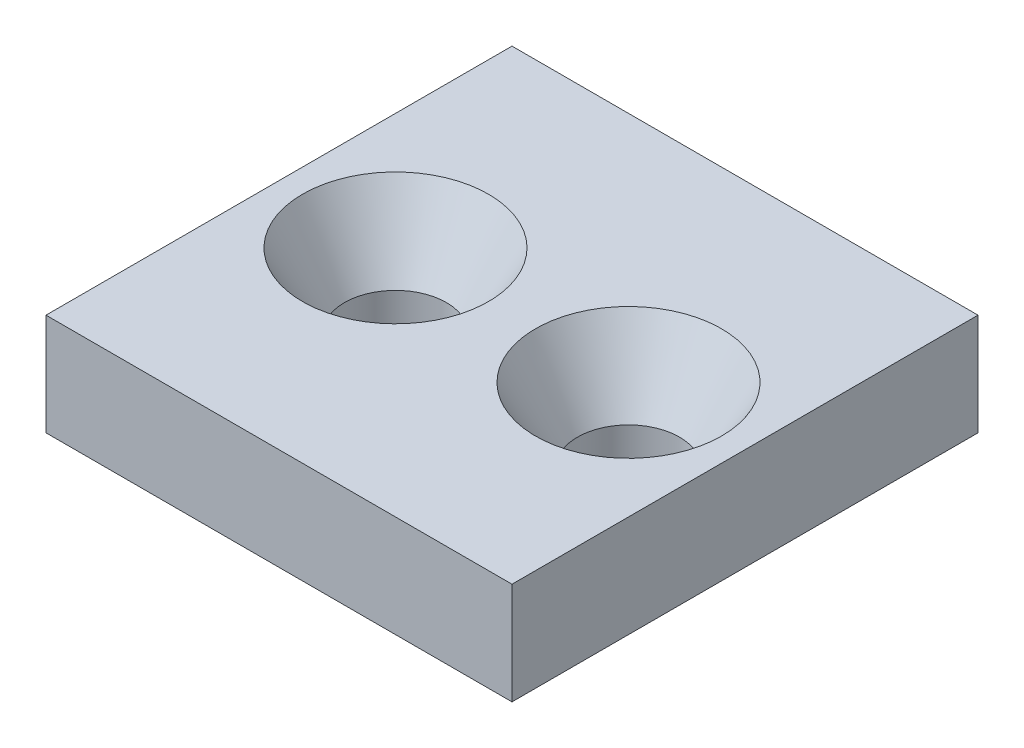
ISO-10303-21;
HEADER;
FILE_DESCRIPTION(('STEP AP214'),'2;1');
FILE_NAME('part.step','',(''),(''),'','','');
FILE_SCHEMA(('AUTOMOTIVE_DESIGN { 1 0 10303 214 1 1 1 1 }'));
ENDSEC;
DATA;
#1=APPLICATION_CONTEXT('core data for automotive mechanical design processes');
#2=APPLICATION_PROTOCOL_DEFINITION('international standard','automotive_design',2000,#1);
#3=PRODUCT_CONTEXT('',#1,'mechanical');
#4=PRODUCT('Part','Part','',(#3));
#5=PRODUCT_RELATED_PRODUCT_CATEGORY('part','',(#4));
#6=PRODUCT_DEFINITION_FORMATION('','',#4);
#7=PRODUCT_DEFINITION_CONTEXT('part definition',#1,'design');
#8=PRODUCT_DEFINITION('design','',#6,#7);
#9=PRODUCT_DEFINITION_SHAPE('','',#8);
#10=(LENGTH_UNIT() NAMED_UNIT(*) SI_UNIT(.MILLI.,.METRE.));
#11=(NAMED_UNIT(*) PLANE_ANGLE_UNIT() SI_UNIT($,.RADIAN.));
#12=(NAMED_UNIT(*) SI_UNIT($,.STERADIAN.) SOLID_ANGLE_UNIT());
#13=UNCERTAINTY_MEASURE_WITH_UNIT(LENGTH_MEASURE(1.E-05),#10,'distance_accuracy_value','');
#14=(GEOMETRIC_REPRESENTATION_CONTEXT(3) GLOBAL_UNCERTAINTY_ASSIGNED_CONTEXT((#13)) GLOBAL_UNIT_ASSIGNED_CONTEXT((#10,
#11,#12)) REPRESENTATION_CONTEXT('',''));
#15=CARTESIAN_POINT('',(0.,0.,0.));
#16=DIRECTION('',(0.,0.,1.));
#17=DIRECTION('',(1.,0.,0.));
#18=AXIS2_PLACEMENT_3D('',#15,#16,#17);
#19=CARTESIAN_POINT('',(-16.,7.,-16.));
#20=DIRECTION('',(1.,0.,0.));
#21=DIRECTION('',(0.,0.,-1.));
#22=AXIS2_PLACEMENT_3D('',#19,#20,#21);
#23=PLANE('',#22);
#24=DIRECTION('',(0.,0.,1.));
#25=VECTOR('',#24,1.);
#26=CARTESIAN_POINT('',(-16.,0.,-16.));
#27=LINE('',#26,#25);
#28=CARTESIAN_POINT('',(-16.,0.,-16.));
#29=VERTEX_POINT('',#28);
#30=CARTESIAN_POINT('',(-16.,0.,16.));
#31=VERTEX_POINT('',#30);
#32=EDGE_CURVE('E78',#29,#31,#27,.T.);
#33=ORIENTED_EDGE('',*,*,#32,.T.);
#34=DIRECTION('',(0.,-1.,0.));
#35=VECTOR('',#34,1.);
#36=CARTESIAN_POINT('',(-16.,7.,16.));
#37=LINE('',#36,#35);
#38=CARTESIAN_POINT('',(-16.,7.,16.));
#39=VERTEX_POINT('',#38);
#40=EDGE_CURVE('E11',#39,#31,#37,.T.);
#41=ORIENTED_EDGE('',*,*,#40,.F.);
#42=DIRECTION('',(0.,0.,1.));
#43=VECTOR('',#42,1.);
#44=CARTESIAN_POINT('',(-16.,7.,-16.));
#45=LINE('',#44,#43);
#46=CARTESIAN_POINT('',(-16.,7.,-16.));
#47=VERTEX_POINT('',#46);
#48=EDGE_CURVE('E101',#47,#39,#45,.T.);
#49=ORIENTED_EDGE('',*,*,#48,.F.);
#50=DIRECTION('',(0.,-1.,0.));
#51=VECTOR('',#50,1.);
#52=CARTESIAN_POINT('',(-16.,7.,-16.));
#53=LINE('',#52,#51);
#54=EDGE_CURVE('E90',#47,#29,#53,.T.);
#55=ORIENTED_EDGE('',*,*,#54,.T.);
#56=EDGE_LOOP('',(#33,#41,#49,#55));
#57=FACE_BOUND('',#56,.T.);
#58=ADVANCED_FACE('F34',(#57),#23,.F.);
#59=CARTESIAN_POINT('',(-16.,7.,16.));
#60=DIRECTION('',(0.,0.,-1.));
#61=DIRECTION('',(-1.,0.,0.));
#62=AXIS2_PLACEMENT_3D('',#59,#60,#61);
#63=PLANE('',#62);
#64=DIRECTION('',(1.,0.,0.));
#65=VECTOR('',#64,1.);
#66=CARTESIAN_POINT('',(-16.,0.,16.));
#67=LINE('',#66,#65);
#68=CARTESIAN_POINT('',(16.,0.,16.));
#69=VERTEX_POINT('',#68);
#70=EDGE_CURVE('E74',#31,#69,#67,.T.);
#71=ORIENTED_EDGE('',*,*,#70,.T.);
#72=DIRECTION('',(0.,-1.,0.));
#73=VECTOR('',#72,1.);
#74=CARTESIAN_POINT('',(16.,7.,16.));
#75=LINE('',#74,#73);
#76=CARTESIAN_POINT('',(16.,7.,16.));
#77=VERTEX_POINT('',#76);
#78=EDGE_CURVE('E41',#77,#69,#75,.T.);
#79=ORIENTED_EDGE('',*,*,#78,.F.);
#80=DIRECTION('',(1.,0.,0.));
#81=VECTOR('',#80,1.);
#82=CARTESIAN_POINT('',(-16.,7.,16.));
#83=LINE('',#82,#81);
#84=EDGE_CURVE('E86',#39,#77,#83,.T.);
#85=ORIENTED_EDGE('',*,*,#84,.F.);
#86=ORIENTED_EDGE('',*,*,#40,.T.);
#87=EDGE_LOOP('',(#71,#79,#85,#86));
#88=FACE_BOUND('',#87,.T.);
#89=ADVANCED_FACE('F85',(#88),#63,.F.);
#90=CARTESIAN_POINT('',(16.,7.,-16.));
#91=DIRECTION('',(-1.,0.,0.));
#92=DIRECTION('',(0.,0.,1.));
#93=AXIS2_PLACEMENT_3D('',#90,#91,#92);
#94=PLANE('',#93);
#95=DIRECTION('',(0.,0.,-1.));
#96=VECTOR('',#95,1.);
#97=CARTESIAN_POINT('',(16.,0.,-16.));
#98=LINE('',#97,#96);
#99=CARTESIAN_POINT('',(16.,0.,-16.));
#100=VERTEX_POINT('',#99);
#101=EDGE_CURVE('E79',#69,#100,#98,.T.);
#102=ORIENTED_EDGE('',*,*,#101,.T.);
#103=DIRECTION('',(0.,-1.,0.));
#104=VECTOR('',#103,1.);
#105=CARTESIAN_POINT('',(16.,7.,-16.));
#106=LINE('',#105,#104);
#107=CARTESIAN_POINT('',(16.,7.,-16.));
#108=VERTEX_POINT('',#107);
#109=EDGE_CURVE('E107',#108,#100,#106,.T.);
#110=ORIENTED_EDGE('',*,*,#109,.F.);
#111=DIRECTION('',(0.,0.,-1.));
#112=VECTOR('',#111,1.);
#113=CARTESIAN_POINT('',(16.,7.,-16.));
#114=LINE('',#113,#112);
#115=EDGE_CURVE('E53',#77,#108,#114,.T.);
#116=ORIENTED_EDGE('',*,*,#115,.F.);
#117=ORIENTED_EDGE('',*,*,#78,.T.);
#118=EDGE_LOOP('',(#102,#110,#116,#117));
#119=FACE_BOUND('',#118,.T.);
#120=ADVANCED_FACE('F110',(#119),#94,.F.);
#121=CARTESIAN_POINT('',(-16.,7.,-16.));
#122=DIRECTION('',(0.,0.,1.));
#123=DIRECTION('',(1.,0.,0.));
#124=AXIS2_PLACEMENT_3D('',#121,#122,#123);
#125=PLANE('',#124);
#126=DIRECTION('',(-1.,0.,0.));
#127=VECTOR('',#126,1.);
#128=CARTESIAN_POINT('',(-16.,0.,-16.));
#129=LINE('',#128,#127);
#130=EDGE_CURVE('E99',#100,#29,#129,.T.);
#131=ORIENTED_EDGE('',*,*,#130,.T.);
#132=ORIENTED_EDGE('',*,*,#54,.F.);
#133=DIRECTION('',(-1.,0.,0.));
#134=VECTOR('',#133,1.);
#135=CARTESIAN_POINT('',(-16.,7.,-16.));
#136=LINE('',#135,#134);
#137=EDGE_CURVE('E48',#108,#47,#136,.T.);
#138=ORIENTED_EDGE('',*,*,#137,.F.);
#139=ORIENTED_EDGE('',*,*,#109,.T.);
#140=EDGE_LOOP('',(#131,#132,#138,#139));
#141=FACE_BOUND('',#140,.T.);
#142=ADVANCED_FACE('F112',(#141),#125,.F.);
#143=CARTESIAN_POINT('',(-16.,7.,16.));
#144=DIRECTION('',(0.,1.,0.));
#145=DIRECTION('',(0.,0.,1.));
#146=AXIS2_PLACEMENT_3D('',#143,#144,#145);
#147=PLANE('',#146);
#148=CARTESIAN_POINT('',(8.,7.,0.));
#149=DIRECTION('',(0.,-1.,0.));
#150=DIRECTION('',(1.,0.,0.));
#151=AXIS2_PLACEMENT_3D('',#148,#149,#150);
#152=CIRCLE('',#151,6.38675134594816);
#153=CARTESIAN_POINT('',(14.3867513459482,7.,0.));
#154=VERTEX_POINT('',#153);
#155=EDGE_CURVE('E201',#154,#154,#152,.T.);
#156=ORIENTED_EDGE('',*,*,#155,.T.);
#157=EDGE_LOOP('',(#156));
#158=FACE_BOUND('',#157,.T.);
#159=CARTESIAN_POINT('',(-8.,7.,0.));
#160=DIRECTION('',(0.,1.,0.));
#161=DIRECTION('',(-1.,0.,0.));
#162=AXIS2_PLACEMENT_3D('',#159,#160,#161);
#163=CIRCLE('',#162,6.38675134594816);
#164=CARTESIAN_POINT('',(-14.3867513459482,7.,0.));
#165=VERTEX_POINT('',#164);
#166=EDGE_CURVE('E91',#165,#165,#163,.T.);
#167=ORIENTED_EDGE('',*,*,#166,.F.);
#168=EDGE_LOOP('',(#167));
#169=FACE_BOUND('',#168,.T.);
#170=ORIENTED_EDGE('',*,*,#48,.T.);
#171=ORIENTED_EDGE('',*,*,#84,.T.);
#172=ORIENTED_EDGE('',*,*,#115,.T.);
#173=ORIENTED_EDGE('',*,*,#137,.T.);
#174=EDGE_LOOP('',(#170,#171,#172,#173));
#175=FACE_BOUND('',#174,.T.);
#176=ADVANCED_FACE('F113',(#158,#169,#175),#147,.T.);
#177=CARTESIAN_POINT('',(-16.,0.,16.));
#178=DIRECTION('',(0.,1.,0.));
#179=DIRECTION('',(0.,0.,1.));
#180=AXIS2_PLACEMENT_3D('',#177,#178,#179);
#181=PLANE('',#180);
#182=CARTESIAN_POINT('',(8.,0.,0.));
#183=DIRECTION('',(0.,-1.,0.));
#184=DIRECTION('',(1.,0.,0.));
#185=AXIS2_PLACEMENT_3D('',#182,#183,#184);
#186=CIRCLE('',#185,3.5);
#187=CARTESIAN_POINT('',(11.5,0.,0.));
#188=VERTEX_POINT('',#187);
#189=EDGE_CURVE('E197',#188,#188,#186,.T.);
#190=ORIENTED_EDGE('',*,*,#189,.F.);
#191=EDGE_LOOP('',(#190));
#192=FACE_BOUND('',#191,.T.);
#193=CARTESIAN_POINT('',(-8.,0.,0.));
#194=DIRECTION('',(0.,1.,0.));
#195=DIRECTION('',(-1.,0.,0.));
#196=AXIS2_PLACEMENT_3D('',#193,#194,#195);
#197=CIRCLE('',#196,3.5);
#198=CARTESIAN_POINT('',(-11.5,0.,0.));
#199=VERTEX_POINT('',#198);
#200=EDGE_CURVE('E203',#199,#199,#197,.T.);
#201=ORIENTED_EDGE('',*,*,#200,.T.);
#202=EDGE_LOOP('',(#201));
#203=FACE_BOUND('',#202,.T.);
#204=ORIENTED_EDGE('',*,*,#32,.F.);
#205=ORIENTED_EDGE('',*,*,#130,.F.);
#206=ORIENTED_EDGE('',*,*,#101,.F.);
#207=ORIENTED_EDGE('',*,*,#70,.F.);
#208=EDGE_LOOP('',(#204,#205,#206,#207));
#209=FACE_BOUND('',#208,.T.);
#210=ADVANCED_FACE('F75',(#192,#203,#209),#181,.F.);
#211=CARTESIAN_POINT('',(-8.,7.,0.));
#212=DIRECTION('',(0.,1.,0.));
#213=DIRECTION('',(-1.,0.,0.));
#214=AXIS2_PLACEMENT_3D('',#211,#212,#213);
#215=CONICAL_SURFACE('',#214,6.38675134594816,0.523598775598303);
#216=CARTESIAN_POINT('',(-8.,2.,0.));
#217=DIRECTION('',(0.,1.,0.));
#218=DIRECTION('',(-1.,0.,0.));
#219=AXIS2_PLACEMENT_3D('',#216,#217,#218);
#220=CIRCLE('',#219,3.5);
#221=CARTESIAN_POINT('',(-11.5,2.,0.));
#222=VERTEX_POINT('',#221);
#223=EDGE_CURVE('E94',#222,#222,#220,.T.);
#224=ORIENTED_EDGE('',*,*,#223,.F.);
#225=EDGE_LOOP('',(#224));
#226=FACE_BOUND('',#225,.T.);
#227=ORIENTED_EDGE('',*,*,#166,.T.);
#228=EDGE_LOOP('',(#227));
#229=FACE_BOUND('',#228,.T.);
#230=ADVANCED_FACE('F121',(#226,#229),#215,.F.);
#231=CARTESIAN_POINT('',(-7.99999999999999,9.9970995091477,0.));
#232=DIRECTION('',(0.,1.,0.));
#233=DIRECTION('',(-1.,0.,0.));
#234=AXIS2_PLACEMENT_3D('',#231,#232,#233);
#235=CYLINDRICAL_SURFACE('',#234,3.5);
#236=ORIENTED_EDGE('',*,*,#200,.F.);
#237=EDGE_LOOP('',(#236));
#238=FACE_BOUND('',#237,.T.);
#239=ORIENTED_EDGE('',*,*,#223,.T.);
#240=EDGE_LOOP('',(#239));
#241=FACE_BOUND('',#240,.T.);
#242=ADVANCED_FACE('F160',(#238,#241),#235,.F.);
#243=CARTESIAN_POINT('',(8.,7.,0.));
#244=DIRECTION('',(0.,1.,0.));
#245=DIRECTION('',(1.,0.,0.));
#246=AXIS2_PLACEMENT_3D('',#243,#244,#245);
#247=CONICAL_SURFACE('',#246,6.38675134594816,0.523598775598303);
#248=CARTESIAN_POINT('',(8.,2.,0.));
#249=DIRECTION('',(0.,-1.,0.));
#250=DIRECTION('',(1.,0.,0.));
#251=AXIS2_PLACEMENT_3D('',#248,#249,#250);
#252=CIRCLE('',#251,3.5);
#253=CARTESIAN_POINT('',(11.5,2.,0.));
#254=VERTEX_POINT('',#253);
#255=EDGE_CURVE('E200',#254,#254,#252,.T.);
#256=ORIENTED_EDGE('',*,*,#255,.T.);
#257=EDGE_LOOP('',(#256));
#258=FACE_BOUND('',#257,.T.);
#259=ORIENTED_EDGE('',*,*,#155,.F.);
#260=EDGE_LOOP('',(#259));
#261=FACE_BOUND('',#260,.T.);
#262=ADVANCED_FACE('F170',(#258,#261),#247,.F.);
#263=CARTESIAN_POINT('',(8.,9.9970995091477,0.));
#264=DIRECTION('',(0.,1.,0.));
#265=DIRECTION('',(1.,0.,0.));
#266=AXIS2_PLACEMENT_3D('',#263,#264,#265);
#267=CYLINDRICAL_SURFACE('',#266,3.5);
#268=ORIENTED_EDGE('',*,*,#189,.T.);
#269=EDGE_LOOP('',(#268));
#270=FACE_BOUND('',#269,.T.);
#271=ORIENTED_EDGE('',*,*,#255,.F.);
#272=EDGE_LOOP('',(#271));
#273=FACE_BOUND('',#272,.T.);
#274=ADVANCED_FACE('F180',(#270,#273),#267,.F.);
#275=CLOSED_SHELL('',(#58,#89,#120,#142,#176,#210,#230,#242,#262,#274));
#276=MANIFOLD_SOLID_BREP('B2',#275);
#277=ADVANCED_BREP_SHAPE_REPRESENTATION('',(#18,#276),#14);
#278=SHAPE_DEFINITION_REPRESENTATION(#9,#277);
ENDSEC;
END-ISO-10303-21;
